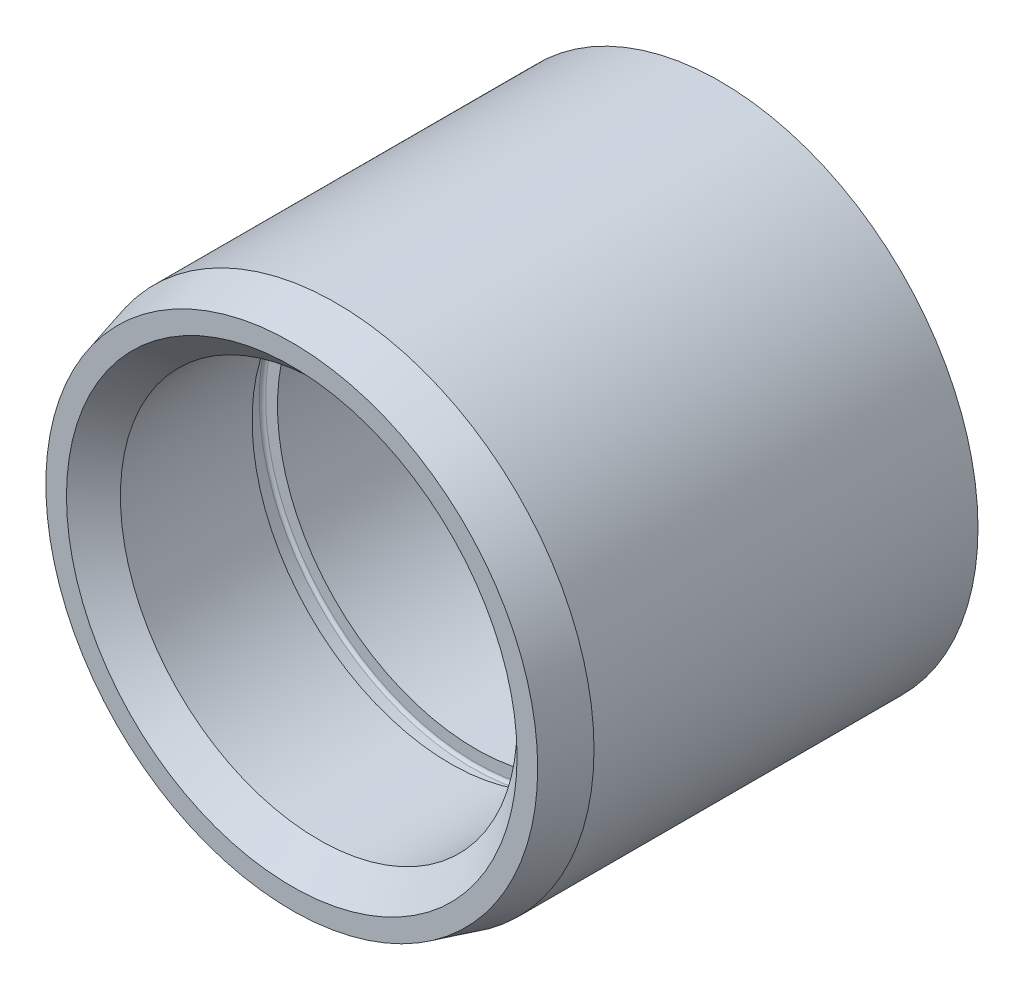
ISO-10303-21;
HEADER;
FILE_DESCRIPTION(('STEP AP214'),'2;1');
FILE_NAME('part.step','',(''),(''),'','','');
FILE_SCHEMA(('AUTOMOTIVE_DESIGN { 1 0 10303 214 1 1 1 1 }'));
ENDSEC;
DATA;
#1=APPLICATION_CONTEXT('core data for automotive mechanical design processes');
#2=APPLICATION_PROTOCOL_DEFINITION('international standard','automotive_design',2000,#1);
#3=PRODUCT_CONTEXT('',#1,'mechanical');
#4=PRODUCT('Part','Part','',(#3));
#5=PRODUCT_RELATED_PRODUCT_CATEGORY('part','',(#4));
#6=PRODUCT_DEFINITION_FORMATION('','',#4);
#7=PRODUCT_DEFINITION_CONTEXT('part definition',#1,'design');
#8=PRODUCT_DEFINITION('design','',#6,#7);
#9=PRODUCT_DEFINITION_SHAPE('','',#8);
#10=(LENGTH_UNIT() NAMED_UNIT(*) SI_UNIT(.MILLI.,.METRE.));
#11=(NAMED_UNIT(*) PLANE_ANGLE_UNIT() SI_UNIT($,.RADIAN.));
#12=(NAMED_UNIT(*) SI_UNIT($,.STERADIAN.) SOLID_ANGLE_UNIT());
#13=UNCERTAINTY_MEASURE_WITH_UNIT(LENGTH_MEASURE(1.E-05),#10,'distance_accuracy_value','');
#14=(GEOMETRIC_REPRESENTATION_CONTEXT(3) GLOBAL_UNCERTAINTY_ASSIGNED_CONTEXT((#13)) GLOBAL_UNIT_ASSIGNED_CONTEXT((#10,
#11,#12)) REPRESENTATION_CONTEXT('',''));
#15=CARTESIAN_POINT('',(0.,0.,0.));
#16=DIRECTION('',(0.,0.,1.));
#17=DIRECTION('',(1.,0.,0.));
#18=AXIS2_PLACEMENT_3D('',#15,#16,#17);
#19=CARTESIAN_POINT('',(0.,25.,-26.4927925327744));
#20=DIRECTION('',(0.,0.,-1.));
#21=DIRECTION('',(-1.,0.,0.));
#22=AXIS2_PLACEMENT_3D('',#19,#20,#21);
#23=PLANE('',#22);
#24=CARTESIAN_POINT('',(0.,0.,-26.4927925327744));
#25=DIRECTION('',(0.,0.,1.));
#26=DIRECTION('',(1.,0.,0.));
#27=AXIS2_PLACEMENT_3D('',#24,#25,#26);
#28=CIRCLE('',#27,25.);
#29=CARTESIAN_POINT('',(25.,0.,-26.4927925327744));
#30=VERTEX_POINT('',#29);
#31=EDGE_CURVE('E11',#30,#30,#28,.T.);
#32=ORIENTED_EDGE('',*,*,#31,.F.);
#33=EDGE_LOOP('',(#32));
#34=FACE_BOUND('',#33,.T.);
#35=CARTESIAN_POINT('',(0.,0.,-26.4927925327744));
#36=DIRECTION('',(0.,0.,1.));
#37=DIRECTION('',(1.,0.,0.));
#38=AXIS2_PLACEMENT_3D('',#35,#36,#37);
#39=CIRCLE('',#38,26.5);
#40=CARTESIAN_POINT('',(26.5,0.,-26.4927925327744));
#41=VERTEX_POINT('',#40);
#42=EDGE_CURVE('E67',#41,#41,#39,.T.);
#43=ORIENTED_EDGE('',*,*,#42,.T.);
#44=EDGE_LOOP('',(#43));
#45=FACE_BOUND('',#44,.T.);
#46=ADVANCED_FACE('F33',(#34,#45),#23,.F.);
#47=CARTESIAN_POINT('',(0.,0.,0.));
#48=DIRECTION('',(0.,0.,1.));
#49=DIRECTION('',(1.,0.,0.));
#50=AXIS2_PLACEMENT_3D('',#47,#48,#49);
#51=CYLINDRICAL_SURFACE('',#50,25.);
#52=CARTESIAN_POINT('',(0.,0.,-57.2927925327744));
#53=DIRECTION('',(0.,0.,1.));
#54=DIRECTION('',(1.,0.,0.));
#55=AXIS2_PLACEMENT_3D('',#52,#53,#54);
#56=CIRCLE('',#55,25.);
#57=CARTESIAN_POINT('',(25.,0.,-57.2927925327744));
#58=VERTEX_POINT('',#57);
#59=EDGE_CURVE('E40',#58,#58,#56,.T.);
#60=ORIENTED_EDGE('',*,*,#59,.F.);
#61=EDGE_LOOP('',(#60));
#62=FACE_BOUND('',#61,.T.);
#63=ORIENTED_EDGE('',*,*,#31,.T.);
#64=EDGE_LOOP('',(#63));
#65=FACE_BOUND('',#64,.T.);
#66=ADVANCED_FACE('F101',(#62,#65),#51,.F.);
#67=CARTESIAN_POINT('',(0.,32.5,-57.2927925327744));
#68=DIRECTION('',(0.,0.,1.));
#69=DIRECTION('',(1.,0.,0.));
#70=AXIS2_PLACEMENT_3D('',#67,#68,#69);
#71=PLANE('',#70);
#72=CARTESIAN_POINT('',(0.,28.75,-57.2927925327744));
#73=DIRECTION('',(0.,0.,-1.));
#74=DIRECTION('',(-1.,0.,0.));
#75=AXIS2_PLACEMENT_3D('',#72,#73,#74);
#76=CIRCLE('',#75,1.65);
#77=CARTESIAN_POINT('',(-1.65,28.75,-57.2927925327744));
#78=VERTEX_POINT('',#77);
#79=EDGE_CURVE('E57',#78,#78,#76,.T.);
#80=ORIENTED_EDGE('',*,*,#79,.F.);
#81=EDGE_LOOP('',(#80));
#82=FACE_BOUND('',#81,.T.);
#83=CARTESIAN_POINT('',(0.,-28.75,-57.2927925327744));
#84=DIRECTION('',(0.,0.,-1.));
#85=DIRECTION('',(-1.,0.,0.));
#86=AXIS2_PLACEMENT_3D('',#83,#84,#85);
#87=CIRCLE('',#86,1.65);
#88=CARTESIAN_POINT('',(-1.65,-28.75,-57.2927925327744));
#89=VERTEX_POINT('',#88);
#90=EDGE_CURVE('E56',#89,#89,#87,.T.);
#91=ORIENTED_EDGE('',*,*,#90,.F.);
#92=EDGE_LOOP('',(#91));
#93=FACE_BOUND('',#92,.T.);
#94=CARTESIAN_POINT('',(0.,0.,-57.2927925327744));
#95=DIRECTION('',(0.,0.,1.));
#96=DIRECTION('',(1.,0.,0.));
#97=AXIS2_PLACEMENT_3D('',#94,#95,#96);
#98=CIRCLE('',#97,32.5);
#99=CARTESIAN_POINT('',(32.5,0.,-57.2927925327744));
#100=VERTEX_POINT('',#99);
#101=EDGE_CURVE('E94',#100,#100,#98,.T.);
#102=ORIENTED_EDGE('',*,*,#101,.F.);
#103=EDGE_LOOP('',(#102));
#104=FACE_BOUND('',#103,.T.);
#105=ORIENTED_EDGE('',*,*,#59,.T.);
#106=EDGE_LOOP('',(#105));
#107=FACE_BOUND('',#106,.T.);
#108=ADVANCED_FACE('F99',(#82,#93,#104,#107),#71,.F.);
#109=CARTESIAN_POINT('',(0.,0.,0.));
#110=DIRECTION('',(0.,0.,1.));
#111=DIRECTION('',(1.,0.,0.));
#112=AXIS2_PLACEMENT_3D('',#109,#110,#111);
#113=CYLINDRICAL_SURFACE('',#112,32.5);
#114=CARTESIAN_POINT('',(0.,0.,-8.89086874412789));
#115=DIRECTION('',(0.,0.,1.));
#116=DIRECTION('',(1.,0.,0.));
#117=AXIS2_PLACEMENT_3D('',#114,#115,#116);
#118=CIRCLE('',#117,32.5);
#119=CARTESIAN_POINT('',(32.5,0.,-8.89086874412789));
#120=VERTEX_POINT('',#119);
#121=EDGE_CURVE('E91',#120,#120,#118,.T.);
#122=ORIENTED_EDGE('',*,*,#121,.F.);
#123=EDGE_LOOP('',(#122));
#124=FACE_BOUND('',#123,.T.);
#125=ORIENTED_EDGE('',*,*,#101,.T.);
#126=EDGE_LOOP('',(#125));
#127=FACE_BOUND('',#126,.T.);
#128=ADVANCED_FACE('F156',(#124,#127),#113,.T.);
#129=CARTESIAN_POINT('',(0.,0.,-8.89086874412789));
#130=DIRECTION('',(0.,0.,-1.));
#131=DIRECTION('',(-1.,0.,0.));
#132=AXIS2_PLACEMENT_3D('',#129,#130,#131);
#133=CONICAL_SURFACE('',#132,32.5,0.261799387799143);
#134=CARTESIAN_POINT('',(0.,0.,-3.29279253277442));
#135=DIRECTION('',(0.,0.,1.));
#136=DIRECTION('',(1.,0.,0.));
#137=AXIS2_PLACEMENT_3D('',#134,#135,#136);
#138=CIRCLE('',#137,31.);
#139=CARTESIAN_POINT('',(31.,0.,-3.29279253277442));
#140=VERTEX_POINT('',#139);
#141=EDGE_CURVE('E88',#140,#140,#138,.T.);
#142=ORIENTED_EDGE('',*,*,#141,.F.);
#143=EDGE_LOOP('',(#142));
#144=FACE_BOUND('',#143,.T.);
#145=ORIENTED_EDGE('',*,*,#121,.T.);
#146=EDGE_LOOP('',(#145));
#147=FACE_BOUND('',#146,.T.);
#148=ADVANCED_FACE('F150',(#144,#147),#133,.T.);
#149=CARTESIAN_POINT('',(0.,28.4,-3.29279253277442));
#150=DIRECTION('',(0.,0.,-1.));
#151=DIRECTION('',(-1.,0.,0.));
#152=AXIS2_PLACEMENT_3D('',#149,#150,#151);
#153=PLANE('',#152);
#154=CARTESIAN_POINT('',(0.,0.,-3.29279253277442));
#155=DIRECTION('',(0.,0.,1.));
#156=DIRECTION('',(1.,0.,0.));
#157=AXIS2_PLACEMENT_3D('',#154,#155,#156);
#158=CIRCLE('',#157,28.4);
#159=CARTESIAN_POINT('',(28.4,0.,-3.29279253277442));
#160=VERTEX_POINT('',#159);
#161=EDGE_CURVE('E85',#160,#160,#158,.T.);
#162=ORIENTED_EDGE('',*,*,#161,.F.);
#163=EDGE_LOOP('',(#162));
#164=FACE_BOUND('',#163,.T.);
#165=ORIENTED_EDGE('',*,*,#141,.T.);
#166=EDGE_LOOP('',(#165));
#167=FACE_BOUND('',#166,.T.);
#168=ADVANCED_FACE('F144',(#164,#167),#153,.F.);
#169=CARTESIAN_POINT('',(0.,0.,-3.29279253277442));
#170=DIRECTION('',(0.,0.,1.));
#171=DIRECTION('',(1.,0.,0.));
#172=AXIS2_PLACEMENT_3D('',#169,#170,#171);
#173=CONICAL_SURFACE('',#172,28.4,0.785398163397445);
#174=CARTESIAN_POINT('',(0.,0.,-6.69279253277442));
#175=DIRECTION('',(0.,0.,1.));
#176=DIRECTION('',(1.,0.,0.));
#177=AXIS2_PLACEMENT_3D('',#174,#175,#176);
#178=CIRCLE('',#177,25.);
#179=CARTESIAN_POINT('',(25.,0.,-6.69279253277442));
#180=VERTEX_POINT('',#179);
#181=EDGE_CURVE('E82',#180,#180,#178,.T.);
#182=ORIENTED_EDGE('',*,*,#181,.F.);
#183=EDGE_LOOP('',(#182));
#184=FACE_BOUND('',#183,.T.);
#185=ORIENTED_EDGE('',*,*,#161,.T.);
#186=EDGE_LOOP('',(#185));
#187=FACE_BOUND('',#186,.T.);
#188=ADVANCED_FACE('F138',(#184,#187),#173,.F.);
#189=CARTESIAN_POINT('',(0.,0.,0.));
#190=DIRECTION('',(0.,0.,1.));
#191=DIRECTION('',(1.,0.,0.));
#192=AXIS2_PLACEMENT_3D('',#189,#190,#191);
#193=CYLINDRICAL_SURFACE('',#192,25.);
#194=CARTESIAN_POINT('',(0.,0.,-23.2927925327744));
#195=DIRECTION('',(0.,0.,1.));
#196=DIRECTION('',(1.,0.,0.));
#197=AXIS2_PLACEMENT_3D('',#194,#195,#196);
#198=CIRCLE('',#197,25.);
#199=CARTESIAN_POINT('',(25.,0.,-23.2927925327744));
#200=VERTEX_POINT('',#199);
#201=EDGE_CURVE('E79',#200,#200,#198,.T.);
#202=ORIENTED_EDGE('',*,*,#201,.F.);
#203=EDGE_LOOP('',(#202));
#204=FACE_BOUND('',#203,.T.);
#205=ORIENTED_EDGE('',*,*,#181,.T.);
#206=EDGE_LOOP('',(#205));
#207=FACE_BOUND('',#206,.T.);
#208=ADVANCED_FACE('F132',(#204,#207),#193,.F.);
#209=CARTESIAN_POINT('',(0.,26.5,-23.2927925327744));
#210=DIRECTION('',(0.,0.,1.));
#211=DIRECTION('',(1.,0.,0.));
#212=AXIS2_PLACEMENT_3D('',#209,#210,#211);
#213=PLANE('',#212);
#214=CARTESIAN_POINT('',(0.,0.,-23.2927925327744));
#215=DIRECTION('',(0.,0.,1.));
#216=DIRECTION('',(1.,0.,0.));
#217=AXIS2_PLACEMENT_3D('',#214,#215,#216);
#218=CIRCLE('',#217,26.5);
#219=CARTESIAN_POINT('',(26.5,0.,-23.2927925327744));
#220=VERTEX_POINT('',#219);
#221=EDGE_CURVE('E76',#220,#220,#218,.T.);
#222=ORIENTED_EDGE('',*,*,#221,.F.);
#223=EDGE_LOOP('',(#222));
#224=FACE_BOUND('',#223,.T.);
#225=ORIENTED_EDGE('',*,*,#201,.T.);
#226=EDGE_LOOP('',(#225));
#227=FACE_BOUND('',#226,.T.);
#228=ADVANCED_FACE('F126',(#224,#227),#213,.F.);
#229=CARTESIAN_POINT('',(0.,0.,-23.6927925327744));
#230=DIRECTION('',(0.,0.,1.));
#231=DIRECTION('',(1.,0.,0.));
#232=AXIS2_PLACEMENT_3D('',#229,#230,#231);
#233=TOROIDAL_SURFACE('',#232,26.5,0.400000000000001);
#234=CARTESIAN_POINT('',(0.,0.,-23.6927925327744));
#235=DIRECTION('',(0.,0.,1.));
#236=DIRECTION('',(1.,0.,0.));
#237=AXIS2_PLACEMENT_3D('',#234,#235,#236);
#238=CIRCLE('',#237,26.9);
#239=CARTESIAN_POINT('',(26.9,0.,-23.6927925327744));
#240=VERTEX_POINT('',#239);
#241=EDGE_CURVE('E73',#240,#240,#238,.T.);
#242=ORIENTED_EDGE('',*,*,#241,.F.);
#243=EDGE_LOOP('',(#242));
#244=FACE_BOUND('',#243,.T.);
#245=ORIENTED_EDGE('',*,*,#221,.T.);
#246=EDGE_LOOP('',(#245));
#247=FACE_BOUND('',#246,.T.);
#248=ADVANCED_FACE('F120',(#244,#247),#233,.F.);
#249=CARTESIAN_POINT('',(0.,0.,0.));
#250=DIRECTION('',(0.,0.,1.));
#251=DIRECTION('',(1.,0.,0.));
#252=AXIS2_PLACEMENT_3D('',#249,#250,#251);
#253=CYLINDRICAL_SURFACE('',#252,26.9);
#254=CARTESIAN_POINT('',(0.,0.,-26.0927925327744));
#255=DIRECTION('',(0.,0.,1.));
#256=DIRECTION('',(1.,0.,0.));
#257=AXIS2_PLACEMENT_3D('',#254,#255,#256);
#258=CIRCLE('',#257,26.9);
#259=CARTESIAN_POINT('',(26.9,0.,-26.0927925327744));
#260=VERTEX_POINT('',#259);
#261=EDGE_CURVE('E70',#260,#260,#258,.T.);
#262=ORIENTED_EDGE('',*,*,#261,.F.);
#263=EDGE_LOOP('',(#262));
#264=FACE_BOUND('',#263,.T.);
#265=ORIENTED_EDGE('',*,*,#241,.T.);
#266=EDGE_LOOP('',(#265));
#267=FACE_BOUND('',#266,.T.);
#268=ADVANCED_FACE('F114',(#264,#267),#253,.F.);
#269=CARTESIAN_POINT('',(0.,0.,-26.0927925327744));
#270=DIRECTION('',(0.,0.,1.));
#271=DIRECTION('',(1.,0.,0.));
#272=AXIS2_PLACEMENT_3D('',#269,#270,#271);
#273=TOROIDAL_SURFACE('',#272,26.5,0.400000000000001);
#274=ORIENTED_EDGE('',*,*,#42,.F.);
#275=EDGE_LOOP('',(#274));
#276=FACE_BOUND('',#275,.T.);
#277=ORIENTED_EDGE('',*,*,#261,.T.);
#278=EDGE_LOOP('',(#277));
#279=FACE_BOUND('',#278,.T.);
#280=ADVANCED_FACE('F110',(#276,#279),#273,.F.);
#281=CARTESIAN_POINT('',(0.,-28.75,-47.2927925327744));
#282=DIRECTION('',(0.,0.,-1.));
#283=DIRECTION('',(-1.,0.,0.));
#284=AXIS2_PLACEMENT_3D('',#281,#282,#283);
#285=CONICAL_SURFACE('',#284,1.65,1.02974425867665);
#286=CARTESIAN_POINT('',(0.,-28.75,-46.3013725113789));
#287=VERTEX_POINT('',#286);
#288=VERTEX_LOOP('',#287);
#289=FACE_BOUND('',#288,.T.);
#290=CARTESIAN_POINT('',(0.,-28.75,-47.2927925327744));
#291=DIRECTION('',(0.,0.,-1.));
#292=DIRECTION('',(-1.,0.,0.));
#293=AXIS2_PLACEMENT_3D('',#290,#291,#292);
#294=CIRCLE('',#293,1.65);
#295=CARTESIAN_POINT('',(-1.65,-28.75,-47.2927925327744));
#296=VERTEX_POINT('',#295);
#297=EDGE_CURVE('E60',#296,#296,#294,.T.);
#298=ORIENTED_EDGE('',*,*,#297,.T.);
#299=EDGE_LOOP('',(#298));
#300=FACE_BOUND('',#299,.T.);
#301=ADVANCED_FACE('F113',(#289,#300),#285,.F.);
#302=CARTESIAN_POINT('',(0.,-28.75,-57.2927925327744));
#303=DIRECTION('',(0.,0.,-1.));
#304=DIRECTION('',(-1.,0.,0.));
#305=AXIS2_PLACEMENT_3D('',#302,#303,#304);
#306=CYLINDRICAL_SURFACE('',#305,1.65);
#307=ORIENTED_EDGE('',*,*,#297,.F.);
#308=EDGE_LOOP('',(#307));
#309=FACE_BOUND('',#308,.T.);
#310=ORIENTED_EDGE('',*,*,#90,.T.);
#311=EDGE_LOOP('',(#310));
#312=FACE_BOUND('',#311,.T.);
#313=ADVANCED_FACE('F50',(#309,#312),#306,.F.);
#314=CARTESIAN_POINT('',(0.,28.75,-47.2927925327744));
#315=DIRECTION('',(0.,0.,-1.));
#316=DIRECTION('',(-1.,0.,0.));
#317=AXIS2_PLACEMENT_3D('',#314,#315,#316);
#318=CONICAL_SURFACE('',#317,1.65,1.02974425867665);
#319=CARTESIAN_POINT('',(0.,28.75,-46.3013725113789));
#320=VERTEX_POINT('',#319);
#321=VERTEX_LOOP('',#320);
#322=FACE_BOUND('',#321,.T.);
#323=CARTESIAN_POINT('',(0.,28.75,-47.2927925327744));
#324=DIRECTION('',(0.,0.,-1.));
#325=DIRECTION('',(-1.,0.,0.));
#326=AXIS2_PLACEMENT_3D('',#323,#324,#325);
#327=CIRCLE('',#326,1.65);
#328=CARTESIAN_POINT('',(-1.65,28.75,-47.2927925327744));
#329=VERTEX_POINT('',#328);
#330=EDGE_CURVE('E54',#329,#329,#327,.T.);
#331=ORIENTED_EDGE('',*,*,#330,.T.);
#332=EDGE_LOOP('',(#331));
#333=FACE_BOUND('',#332,.T.);
#334=ADVANCED_FACE('F46',(#322,#333),#318,.F.);
#335=CARTESIAN_POINT('',(0.,28.75,-57.2927925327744));
#336=DIRECTION('',(0.,0.,-1.));
#337=DIRECTION('',(-1.,0.,0.));
#338=AXIS2_PLACEMENT_3D('',#335,#336,#337);
#339=CYLINDRICAL_SURFACE('',#338,1.65);
#340=ORIENTED_EDGE('',*,*,#330,.F.);
#341=EDGE_LOOP('',(#340));
#342=FACE_BOUND('',#341,.T.);
#343=ORIENTED_EDGE('',*,*,#79,.T.);
#344=EDGE_LOOP('',(#343));
#345=FACE_BOUND('',#344,.T.);
#346=ADVANCED_FACE('F49',(#342,#345),#339,.F.);
#347=CLOSED_SHELL('',(#46,#66,#108,#128,#148,#168,#188,#208,#228,#248,#268,#280,#301,#313,#334,#346));
#348=MANIFOLD_SOLID_BREP('B2',#347);
#349=ADVANCED_BREP_SHAPE_REPRESENTATION('',(#18,#348),#14);
#350=SHAPE_DEFINITION_REPRESENTATION(#9,#349);
ENDSEC;
END-ISO-10303-21;
